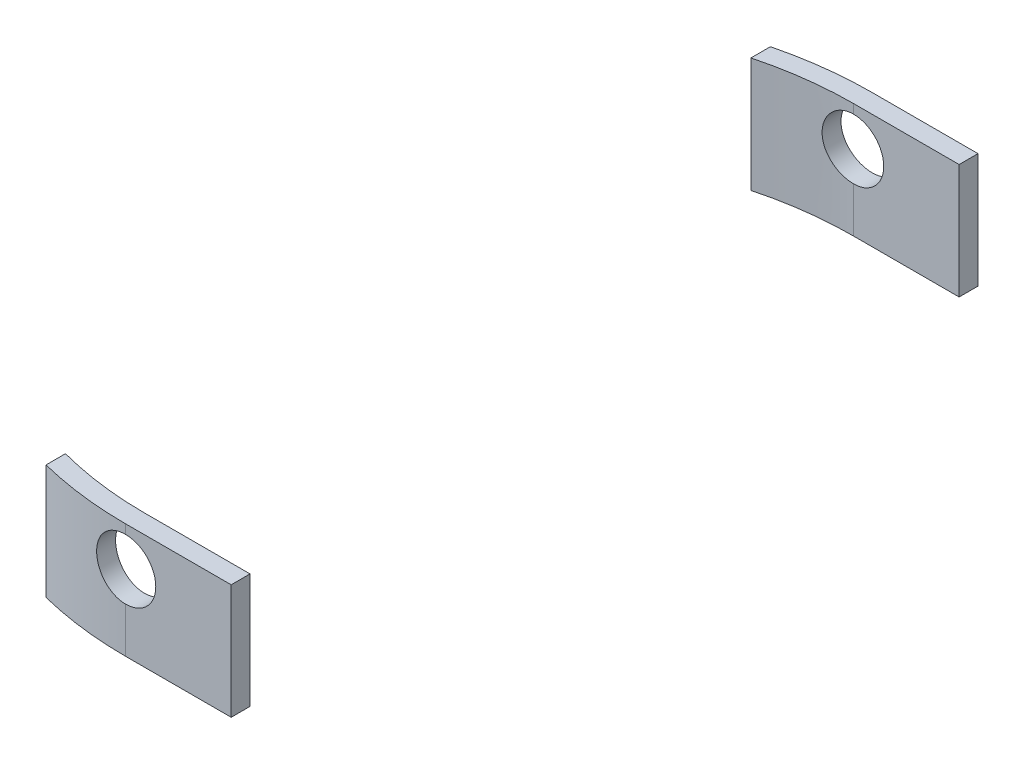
from build123d import *

# Parameters (mm, degrees)
SKETCH_2_W           = 50
SKETCH_2_H           = 50
EXTRUDE_2_DEPTH      = 2
SKETCH_6_W           = 68.418235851
SKETCH_6_H           = 62.547603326
CUT_EXTRUDE_4_DEPTH  = 2
CUT_EXTRUDE_5_DEPTH  = 2
CUT_EXTRUDE_6_DEPTH  = 0.9
EXTRUDE_3_DEPTH      = 2
EXTRUDE_4_DEPTH      = 16.3
EXTRUDE_4_DEPTH_BACK = 2
SKETCH_12_W          = 2
SKETCH_12_H          = 39.6
CUT_EXTRUDE_8_DEPTH  = 11
SKETCH_13_R          = 23
SKETCH_13_R_2        = 19.234840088
EXTRUDE_5_DEPTH      = 0.8
SKETCH_14_R          = 23
SKETCH_14_R_2        = 22.4
EXTRUDE_6_DEPTH      = 4
SKETCH_15_R          = 1.6
CUT_EXTRUDE_9_DEPTH  = 1.2
CUT_EXTRUDE_START    = -1.2
SKETCH_16_R          = 1.6
CUT_EXTRUDE_10_DEPTH = 1.2
SKETCH_17_R          = 15
SKETCH_17_R_2        = 14
CUT_EXTRUDE_11_DEPTH = 0.6
SKETCH_18_R          = 1.5
CUT_EXTRUDE_12_DEPTH = 0.7
CUT_EXTRUDE_13_DEPTH = 8
SKETCH_20_R          = 17
SKETCH_20_R_2        = 16.5
EXTRUDE_7_DEPTH      = 3
CUT_EXTRUDE_14_DEPTH = 50


with BuildPart() as part:
    # Sketch 2 → Extrude 2 (new body)
    with BuildSketch(Plane(origin=(0, 0, 0), x_dir=(1, 0, 0), z_dir=(0, 1, 0))):
        Rectangle(SKETCH_2_W, SKETCH_2_H)
    extrude(amount=EXTRUDE_2_DEPTH)

    # Sketch 6 → Cut-Extrude 4 (cut)
    with BuildSketch(Plane(origin=(19.566219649, 2, 0), x_dir=(1, 0, 0), z_dir=(0, 1, 0))):
        with Locations((-16.859445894, -2.398316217)):
            Rectangle(SKETCH_6_W, SKETCH_6_H)
        with BuildLine():
            Line((-19.566219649, -18.5), (-11.966877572, -18.5))
            ThreePointArc((-11.966877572, -18.5), (0.433780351, 0), (-11.966877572, 18.5))
            Line((-11.966877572, 18.5), (-19.566219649, 18.5))
            ThreePointArc((-19.566219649, 18.5), (-38.066219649, 0), (-19.566219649, -18.5))
        make_face(mode=Mode.SUBTRACT)
    extrude(amount=-CUT_EXTRUDE_4_DEPTH, mode=Mode.SUBTRACT)

    # Sketch 7 → Cut-Extrude 5 (cut)
    with BuildSketch(Plane(origin=(19.566219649, 0, 0), x_dir=(-1, 0, 0), z_dir=(0, -1, 0))):
        Polygon((19.566219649, 11.749077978), (9.391219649, 5.874538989), (9.391219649, -5.874538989), (19.566219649, -11.749077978), (29.741219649, -5.874538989), (29.741219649, 5.874538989), align=None)
    extrude(amount=-CUT_EXTRUDE_5_DEPTH, mode=Mode.SUBTRACT)

    # Sketch 8 → Cut-Extrude 6 (cut)
    with BuildSketch(Plane(origin=(0, 2, 0), x_dir=(1, 0, 0), z_dir=(0, 1, 0))):
        with BuildLine():
            Line((12.375, 6.8), (12.375, -6.8))
            ThreePointArc((12.375, -6.8), (7.323143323, -12.092998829), (0.251874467, -13.972958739))
            Line((0.251874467, -13.972958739), (-11.526071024, -7.172958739))
            ThreePointArc((-11.526071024, -7.172958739), (-13.684084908, 0), (-11.526071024, 7.172958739))
            Line((-11.526071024, 7.172958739), (0.251874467, 13.972958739))
            ThreePointArc((0.251874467, 13.972958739), (7.323143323, 12.092998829), (12.375, 6.8))
        make_face()
    extrude(amount=-CUT_EXTRUDE_6_DEPTH, mode=Mode.SUBTRACT)

    # Sketch 9 → Extrude 3 (add)
    with BuildSketch(Plane(origin=(0, 2, 0), x_dir=(1, 0, 0), z_dir=(0, 1, 0))):
        with BuildLine():
            Line((7.599342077, 18.8), (0, 18.8))
            ThreePointArc((0, 18.8), (-18.8, 0), (0, -18.8))
            Line((0, -18.8), (7.599342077, -18.8))
            ThreePointArc((7.599342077, -18.8), (20.277820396, 0), (7.599342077, 18.8))
        make_face()
        with BuildLine():
            Line((0, 18.5), (7.599342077, 18.5))
            ThreePointArc((7.599342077, 18.5), (20, 0), (7.599342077, -18.5))
            Line((7.599342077, -18.5), (0, -18.5))
            ThreePointArc((0, -18.5), (-18.5, 0), (0, 18.5))
        make_face(mode=Mode.SUBTRACT)
    extrude(amount=-EXTRUDE_3_DEPTH)

    # Sketch 11 → Extrude 4 (add, two sides: drawn at the far end of the back side and taken through both)
    with BuildSketch(Plane(origin=(0, 2, 0), x_dir=(1, 0, 0), z_dir=(0, 1, 0)).offset(-EXTRUDE_4_DEPTH_BACK)):
        with BuildLine():
            Line((7.599342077, 19.8), (0, 19.8))
            ThreePointArc((0, 19.8), (-19.8, 0), (0, -19.8))
            Line((0, -19.8), (7.599342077, -19.8))
            ThreePointArc((7.599342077, -19.8), (21.208253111, 0), (7.599342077, 19.8))
        make_face()
        with BuildLine():
            Line((0, 18.8), (7.599342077, 18.8))
            ThreePointArc((7.599342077, 18.8), (20.277820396, 0), (7.599342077, -18.8))
            Line((7.599342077, -18.8), (0, -18.8))
            ThreePointArc((0, -18.8), (-18.8, 0), (0, 18.8))
        make_face(mode=Mode.SUBTRACT)
    extrude(amount=EXTRUDE_4_DEPTH + EXTRUDE_4_DEPTH_BACK)

    # Sketch 12 → Cut-Extrude 8 (cut)
    with BuildSketch(Plane(origin=(0, 18.3, 0), x_dir=(1, 0, 0), z_dir=(0, 1, 0))):
        with Locations((6.599342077, 0)):
            Rectangle(SKETCH_12_W, SKETCH_12_H)
    extrude(amount=-CUT_EXTRUDE_8_DEPTH, mode=Mode.SUBTRACT)

    # Sketch 13 → Extrude 5 (add)
    with BuildSketch(Plane(origin=(0, 0, 0), x_dir=(-1, 0, 0), z_dir=(0, -1, 0))):
        with Locations(Location((-1, 0, 0), (0, 0, 90))):
            Circle(SKETCH_13_R)
        with Locations((-1, 0)):
            Circle(SKETCH_13_R_2, mode=Mode.SUBTRACT)
    extrude(amount=-EXTRUDE_5_DEPTH)

    # Sketch 14 → Extrude 6 (add)
    with BuildSketch(Plane(origin=(0, 0.8, 0), x_dir=(1, 0, 0), z_dir=(0, 1, 0))):
        with Locations(Location((1, 0, 0), (0, 0, 90))):
            Circle(SKETCH_14_R)
        with Locations(Location((1, 0, 0), (0, 0, 270))):
            Circle(SKETCH_14_R_2, mode=Mode.SUBTRACT)
    extrude(amount=EXTRUDE_6_DEPTH)

    # Sketch 15 → Cut-Extrude 9 (cut)
    with BuildSketch(Plane(origin=(19.566219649, 18.450605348, -19.8), x_dir=(-1, 0, 0), z_dir=(0, 0, -1))):
        with Locations(Location((19.566219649, -2.238105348, 0), (0, 0, 90))):
            Circle(SKETCH_15_R)
    extrude(amount=-CUT_EXTRUDE_9_DEPTH, mode=Mode.SUBTRACT)

    # Sketch 16 → Cut-Extrude 10 (cut)
    with BuildSketch(Plane(origin=(19.566219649, 18.450605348, 19.8), x_dir=(1, 0, 0), z_dir=(0, 0, 1)).offset(CUT_EXTRUDE_START)):
        with Locations(Location((-19.566219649, -2.238105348, 0), (0, 0, 90))):
            Circle(SKETCH_16_R)
    extrude(amount=CUT_EXTRUDE_10_DEPTH, mode=Mode.SUBTRACT)

    # Sketch 17 → Cut-Extrude 11 (cut)
    with BuildSketch(Plane(origin=(0, 0, 0), x_dir=(-1, 0, 0), z_dir=(0, -1, 0))):
        with Locations(Location((0, 0, 0), (0, 0, 90))):
            Circle(SKETCH_17_R)
        with Locations(Location((0, 0, 0), (0, 0, 90))):
            Circle(SKETCH_17_R_2, mode=Mode.SUBTRACT)
    extrude(amount=-CUT_EXTRUDE_11_DEPTH, mode=Mode.SUBTRACT)

    # Sketch 18 → Cut-Extrude 12 (cut)
    with BuildSketch(Plane(origin=(0, 0, 0), x_dir=(-1, 0, 0), z_dir=(0, -1, 0))):
        with Locations(Location((-22, 0, 0), (0, 0, 90))):
            Circle(SKETCH_18_R)
    extrude(amount=-CUT_EXTRUDE_12_DEPTH, mode=Mode.SUBTRACT)

    # Sketch 19 → Cut-Extrude 13 (cut)
    with BuildSketch(Plane(origin=(0, 18.3, 0), x_dir=(1, 0, 0), z_dir=(0, 1, 0))):
        Polygon((7.709756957, 23.363856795), (0, 0), (27.121107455, 11.774942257), align=None)
        Polygon((28.071534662, -11.787732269), (0, 0), (8.071294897, -24.564680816), align=None)
    extrude(amount=-CUT_EXTRUDE_13_DEPTH, mode=Mode.SUBTRACT)

    # Sketch 20 → Extrude 7 (add)
    with BuildSketch(Plane.XZ):
        with Locations(Location((0, 0, 0), (0, 0, 90))):
            Circle(SKETCH_20_R)
        with Locations(Location((0, 0, 0), (0, 0, 270))):
            Circle(SKETCH_20_R_2, mode=Mode.SUBTRACT)
    extrude(amount=EXTRUDE_7_DEPTH)

    # Sketch 21 → Cut-Extrude 14 (cut, symmetric)
    with BuildSketch(Plane.XY.offset(19.8)):
        Polygon((-25.844547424, 12.214249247), (-25.844547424, 21.613221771), (-4.815191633, 21.613221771), (-4.815191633, 12.214249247), (12.731811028, 12.214249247), (12.731811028, 22.018932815), (26.79646056, 22.018932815), (26.79646056, 12.214249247), (26.79646056, -5.501799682), (-25.844547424, -5.501799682), align=None)
    extrude(amount=CUT_EXTRUDE_14_DEPTH, both=True, mode=Mode.SUBTRACT)


with BuildPart() as cut_extrude_14_piece_1:
    # of the separate pieces the step leaves, piece 1, a body of its own (cut_extrude_14_pieces)
    add(part.part.solids().sort_by_distance((0, 18.3, -19.8))[0])


with BuildPart() as cut_extrude_14_piece_2:
    # of the separate pieces the step leaves, piece 2, a body of its own (cut_extrude_14_pieces)
    add(part.part.solids().sort_by_distance((0, 18.3, 19.8))[0])


solid = Compound([cut_extrude_14_piece_1.part, cut_extrude_14_piece_2.part])
